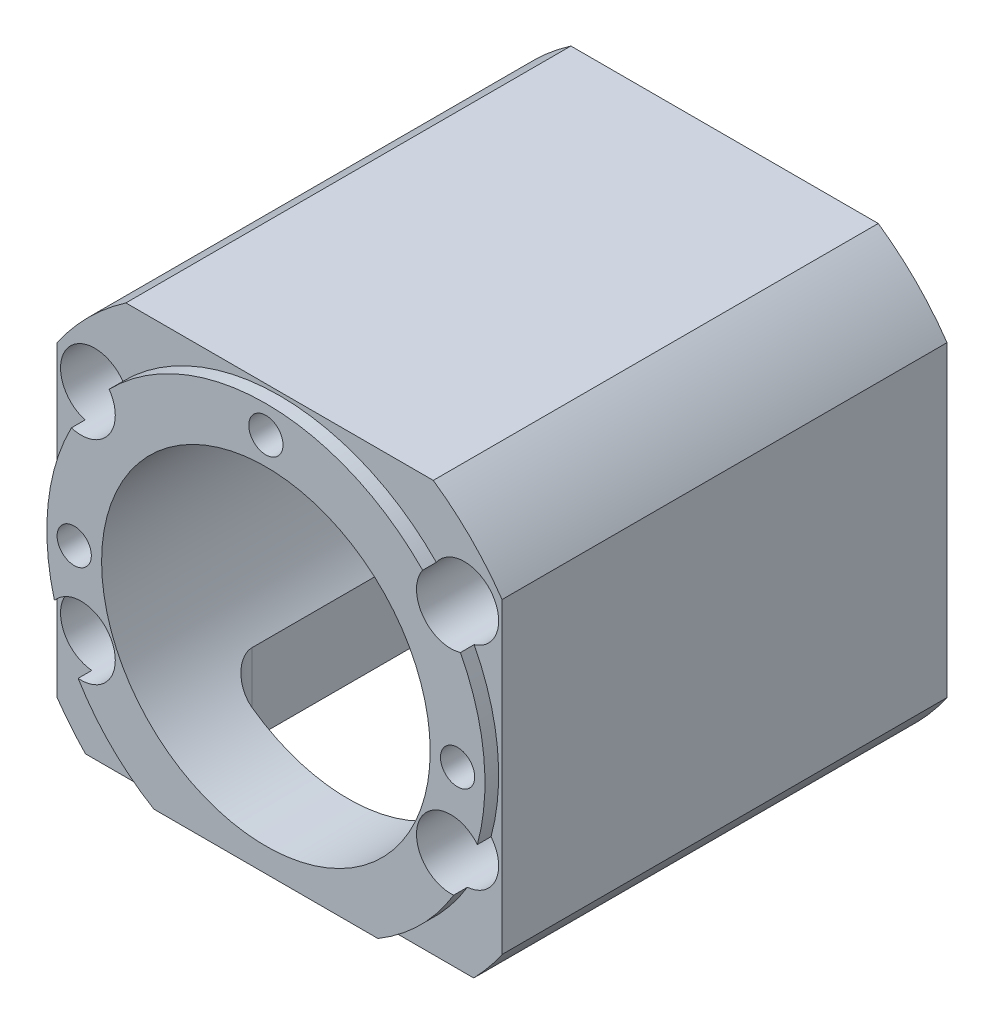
from build123d import *

# Parameters (mm, degrees)
SKETCH_1_R                     = 24
EXTRUDE_1_DEPTH                = 67
SKETCH_2_R                     = 59.294697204
SKETCH_2_R_2                   = 32
CUT_EXTRUDE_1_DEPTH            = 2
HOLE_WIZARD_M5_1_D             = 5.5
HOLE_WIZARD_M5_1_CBORE_D       = 10
HOLE_WIZARD_M5_1_CBORE_DEPTH   = 44
SKETCH_5_W                     = 112.697995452
SKETCH_5_H                     = 115.710166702
CUT_EXTRUDE_2_DEPTH            = 5
HOLE_WIZARD_M5_1_2_D           = 4.2
HOLE_WIZARD_M5_1_2_DEPTH       = 18.4
HOLE_WIZARD_M5_1_2_CBORE_D     = 5
HOLE_WIZARD_M5_1_2_CBORE_DEPTH = 16
HOLE_WIZARD_M5_1_2_TIP         = 1.2618073
SKETCH_9_W                     = 36
SKETCH_9_H                     = 43
CUT_EXTRUDE_4_DEPTH            = 18
FILLET_1_R                     = 4


with BuildPart() as part:
    # Sketch 1 → Extrude 1 (new body)
    with BuildSketch(Plane.XY):
        with BuildLine():
            Line((2.576638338, 36.48208852), (47.476526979, 36.48208852))
            ThreePointArc((47.476526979, 36.48208852), (52.957300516, 31.912806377), (57.526582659, 26.432032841))
            Line((57.526582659, 26.432032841), (57.526582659, -18.467855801))
            ThreePointArc((57.526582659, -18.467855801), (52.957300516, -23.948629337), (47.476526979, -28.51791148))
            Line((47.476526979, -28.51791148), (2.576638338, -28.51791148))
            ThreePointArc((2.576638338, -28.51791148), (-2.904135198, -23.948629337), (-7.473417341, -18.467855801))
            Line((-7.473417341, -18.467855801), (-7.473417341, 26.432032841))
            ThreePointArc((-7.473417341, 26.432032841), (-2.904135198, 31.912806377), (2.576638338, 36.48208852))
        make_face()
        with Locations((25.026582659, 3.98208852)):
            Circle(SKETCH_1_R, mode=Mode.SUBTRACT)
    extrude(amount=EXTRUDE_1_DEPTH)

    # Sketch 2 → Cut-Extrude 1 (cut)
    with BuildSketch(Plane.XY.offset(67)):
        with Locations((25.026582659, 3.98208852)):
            Circle(SKETCH_2_R)
        with Locations((25.026582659, 3.98208852)):
            Circle(SKETCH_2_R_2, mode=Mode.SUBTRACT)
    extrude(amount=-CUT_EXTRUDE_1_DEPTH, mode=Mode.SUBTRACT)

    # Hole Wizard M5 _1 (through all)
    with Locations(Plane.XY.offset(67)):
        with Locations((-1.973417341, 23.48208852), (52.026582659, 23.48208852), (52.026582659, -7.51791148), (-1.973417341, -7.51791148)):
            CounterBoreHole(HOLE_WIZARD_M5_1_D / 2, HOLE_WIZARD_M5_1_CBORE_D / 2, HOLE_WIZARD_M5_1_CBORE_DEPTH)

    # Sketch 5 → Cut-Extrude 2 (cut)
    with BuildSketch(Plane.XZ.offset(28.51791148)):
        with Locations((25.583407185, 32.259749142)):
            Rectangle(SKETCH_5_W, SKETCH_5_H)
    extrude(amount=-CUT_EXTRUDE_2_DEPTH, mode=Mode.SUBTRACT)

    # Hole Wizard M5 _1 2
    with Locations(Plane.XY.offset(67)):
        with Locations((-2.973417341, 3.98208852), (25.026582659, 31.98208852), (53.026582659, 3.98208852)):
            CounterBoreHole(HOLE_WIZARD_M5_1_2_D / 2, HOLE_WIZARD_M5_1_2_CBORE_D / 2, HOLE_WIZARD_M5_1_2_CBORE_DEPTH, depth=HOLE_WIZARD_M5_1_2_DEPTH)
            with Locations((0, 0, -(HOLE_WIZARD_M5_1_2_DEPTH + HOLE_WIZARD_M5_1_2_TIP / 2))):  # 118° drill point
                Cone(0, HOLE_WIZARD_M5_1_2_D / 2, HOLE_WIZARD_M5_1_2_TIP, mode=Mode.SUBTRACT)

    # Sketch 9 → Cut-Extrude 4 (cut)
    with BuildSketch(Plane.XZ.offset(23.51791148)):
        with Locations((25.026582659, 33.5)):
            Rectangle(SKETCH_9_W, SKETCH_9_H)
    extrude(amount=-CUT_EXTRUDE_4_DEPTH, mode=Mode.SUBTRACT)

    # Fillet 1
    fillet_1_edges = [part.edges().sort_by_distance(p)[0] for p in [
        (43.026582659, -17.705165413, 55),
        (43.026582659, -17.705165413, 12),
        (7.026582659, -17.705165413, 12),
        (7.026582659, -17.705165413, 55),
    ]]
    fillet(fillet_1_edges, radius=FILLET_1_R)


solid = part.part
